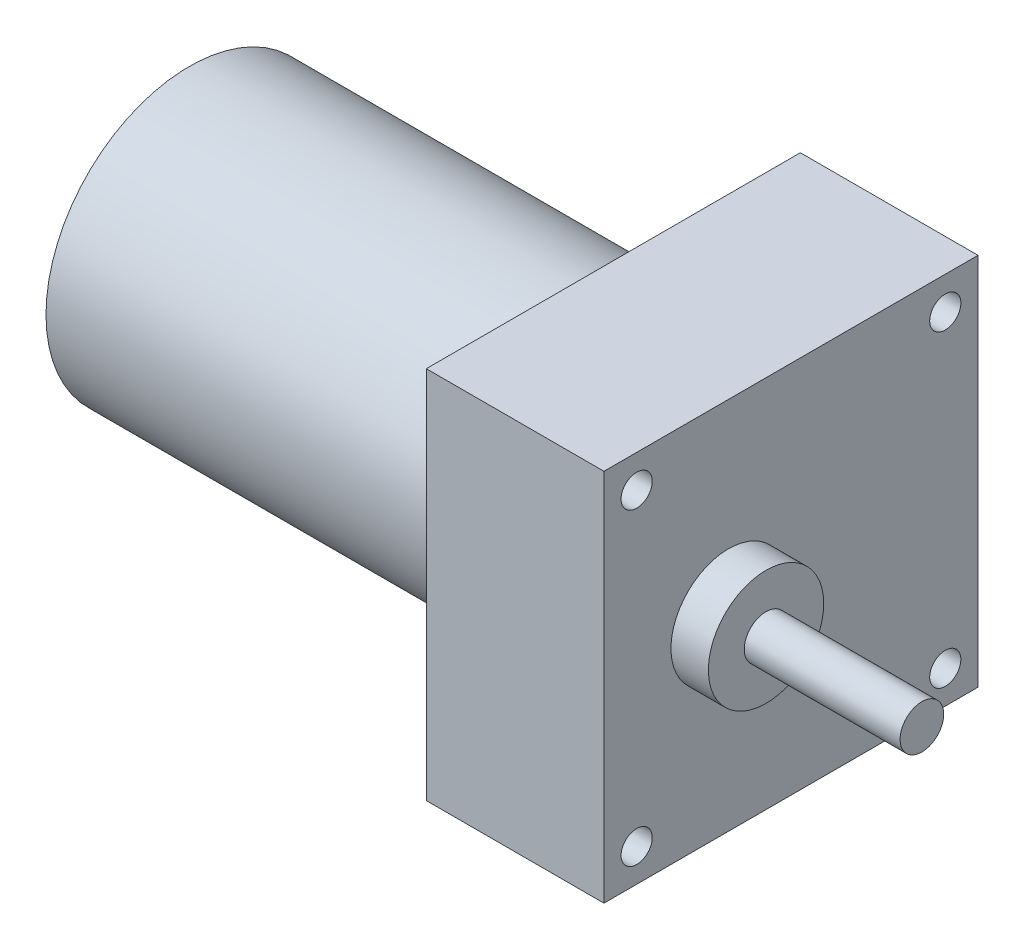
from build123d import *

# Parameters (mm, degrees)
SKETCH1_W           = 60
SKETCH1_H           = 60
SKETCH1_R           = 2.5
SKETCH1_R_2         = 9.25
SKETCH1_R_3         = 3.5
BOSS_EXTRUDE1_DEPTH = 28.5
BOSS_EXTRUDE2_START = 28.5
SKETCH1_3_R         = 9.25
SKETCH1_3_R_2       = 3.5
BOSS_EXTRUDE2_DEPTH = 6
BOSS_EXTRUDE3_START = 34.5
SKETCH1_4_R         = 3.5
BOSS_EXTRUDE3_DEPTH = 25
SKETCH2_R           = 23
BOSS_EXTRUDE4_DEPTH = 68


with BuildPart() as part:
    # Sketch1 → Boss-Extrude1 (new body)
    # profile 1 of 3: a face of its own
    with BuildSketch(Plane.YZ):
        Rectangle(SKETCH1_W, SKETCH1_H)
        with Locations(Location((24.75, 24.75, 0), (0, 0, 90))):
            Circle(SKETCH1_R, mode=Mode.SUBTRACT)
        with Locations(Location((-24.75, 24.75, 0), (0, 0, 90))):
            Circle(SKETCH1_R, mode=Mode.SUBTRACT)
        with Locations(Location((24.75, -24.75, 0), (0, 0, 90))):
            Circle(SKETCH1_R, mode=Mode.SUBTRACT)
        with Locations(Location((-24.75, -24.75, 0), (0, 0, 90))):
            Circle(SKETCH1_R, mode=Mode.SUBTRACT)
    # profile 2 of 3: a face of its own
    with BuildSketch(Plane.YZ):
        with Locations((0, 10)):
            Circle(SKETCH1_R_2)
        with Locations((0, 10)):
            Circle(SKETCH1_R_3, mode=Mode.SUBTRACT)
    # profile 3 of 3: a face of its own
    with BuildSketch(Plane.YZ):
        with Locations((0, 10)):
            Circle(SKETCH1_R_3)
    extrude(amount=BOSS_EXTRUDE1_DEPTH)

    # Sketch1_3 → Boss-Extrude2 (add)
    with BuildSketch(Plane.YZ.offset(BOSS_EXTRUDE2_START)):
        with Locations(Location((0, 10, 0), (0, 0, 270))):
            Circle(SKETCH1_3_R)
        with Locations(Location((0, 10, 0), (0, 0, 270))):
            Circle(SKETCH1_3_R_2, mode=Mode.SUBTRACT)
    extrude(amount=BOSS_EXTRUDE2_DEPTH)

    # Sketch2 → Boss-Extrude4 (add)
    with BuildSketch(Plane(origin=(0, 0, 0), x_dir=(0, -1, 0), z_dir=(-1, 0, 0))):
        with Locations(Location((0, 0, 0), (0, 0, 270))):
            Circle(SKETCH2_R)
    extrude(amount=BOSS_EXTRUDE4_DEPTH)


with BuildPart() as body_2:
    # Sketch1_4 → Boss-Extrude3 (new body)
    with BuildSketch(Plane.YZ.offset(BOSS_EXTRUDE3_START)):
        with Locations(Location((0, 10, 0), (0, 0, 270))):
            Circle(SKETCH1_4_R)
    extrude(amount=BOSS_EXTRUDE3_DEPTH)


solid = Compound([part.part, body_2.part])
